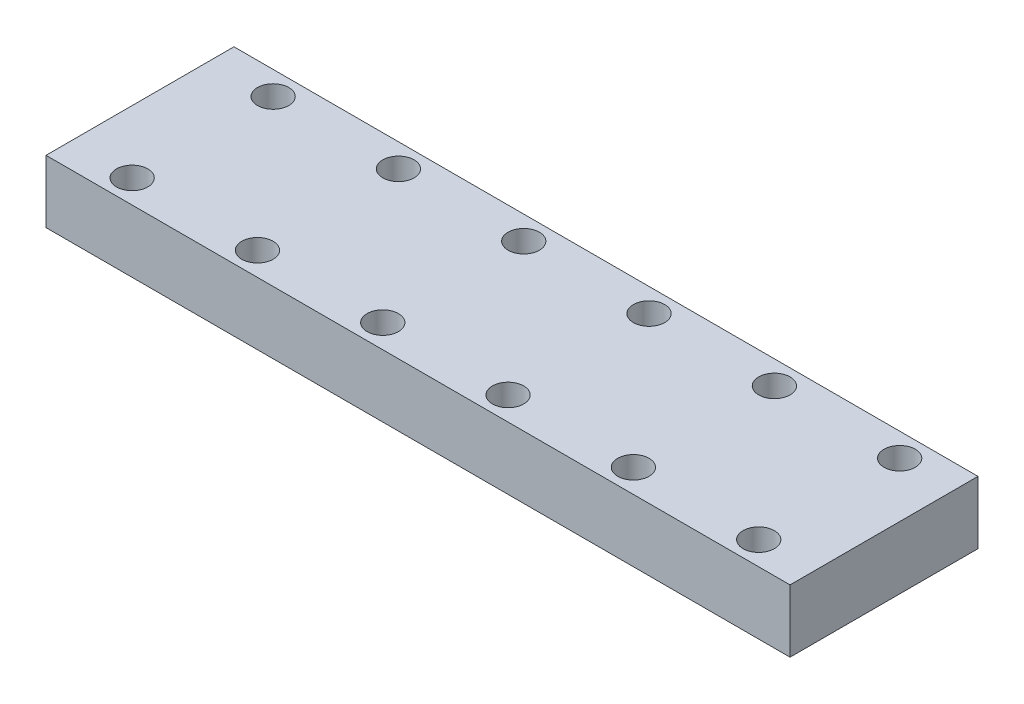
from build123d import *

# Parameters (mm, degrees)
SKETCH_1_W      = 95
SKETCH_1_H      = 24
SKETCH_1_R      = 2
EXTRUDE_1_DEPTH = 8


with BuildPart() as part:
    # Sketch 1 → Extrude 1 (new body)
    with BuildSketch(Plane(origin=(0, 0, 0), x_dir=(1, 0, 0), z_dir=(0, 1, 0))):
        with Locations((29.209251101, 1.162995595)):
            Rectangle(SKETCH_1_W, SKETCH_1_H)
        with Locations(Location((-10.290748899, 10.162995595, 0), (0, 0, 270))):
            Circle(SKETCH_1_R, mode=Mode.SUBTRACT)
        with Locations(Location((5.709251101, 10.162995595, 0), (0, 0, 270))):
            Circle(SKETCH_1_R, mode=Mode.SUBTRACT)
        with Locations(Location((21.709251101, 10.162995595, 0), (0, 0, 270))):
            Circle(SKETCH_1_R, mode=Mode.SUBTRACT)
        with Locations(Location((37.709251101, 10.162995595, 0), (0, 0, 270))):
            Circle(SKETCH_1_R, mode=Mode.SUBTRACT)
        with Locations(Location((53.709251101, 10.162995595, 0), (0, 0, 270))):
            Circle(SKETCH_1_R, mode=Mode.SUBTRACT)
        with Locations(Location((69.709251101, 10.162995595, 0), (0, 0, 270))):
            Circle(SKETCH_1_R, mode=Mode.SUBTRACT)
        with Locations(Location((-10.290748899, -7.837004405, 0), (0, 0, 270))):
            Circle(SKETCH_1_R, mode=Mode.SUBTRACT)
        with Locations(Location((5.709251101, -7.837004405, 0), (0, 0, 270))):
            Circle(SKETCH_1_R, mode=Mode.SUBTRACT)
        with Locations(Location((21.709251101, -7.837004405, 0), (0, 0, 270))):
            Circle(SKETCH_1_R, mode=Mode.SUBTRACT)
        with Locations(Location((37.709251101, -7.837004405, 0), (0, 0, 270))):
            Circle(SKETCH_1_R, mode=Mode.SUBTRACT)
        with Locations(Location((53.709251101, -7.837004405, 0), (0, 0, 270))):
            Circle(SKETCH_1_R, mode=Mode.SUBTRACT)
        with Locations(Location((69.709251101, -7.837004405, 0), (0, 0, 270))):
            Circle(SKETCH_1_R, mode=Mode.SUBTRACT)
    extrude(amount=EXTRUDE_1_DEPTH)


solid = part.part
